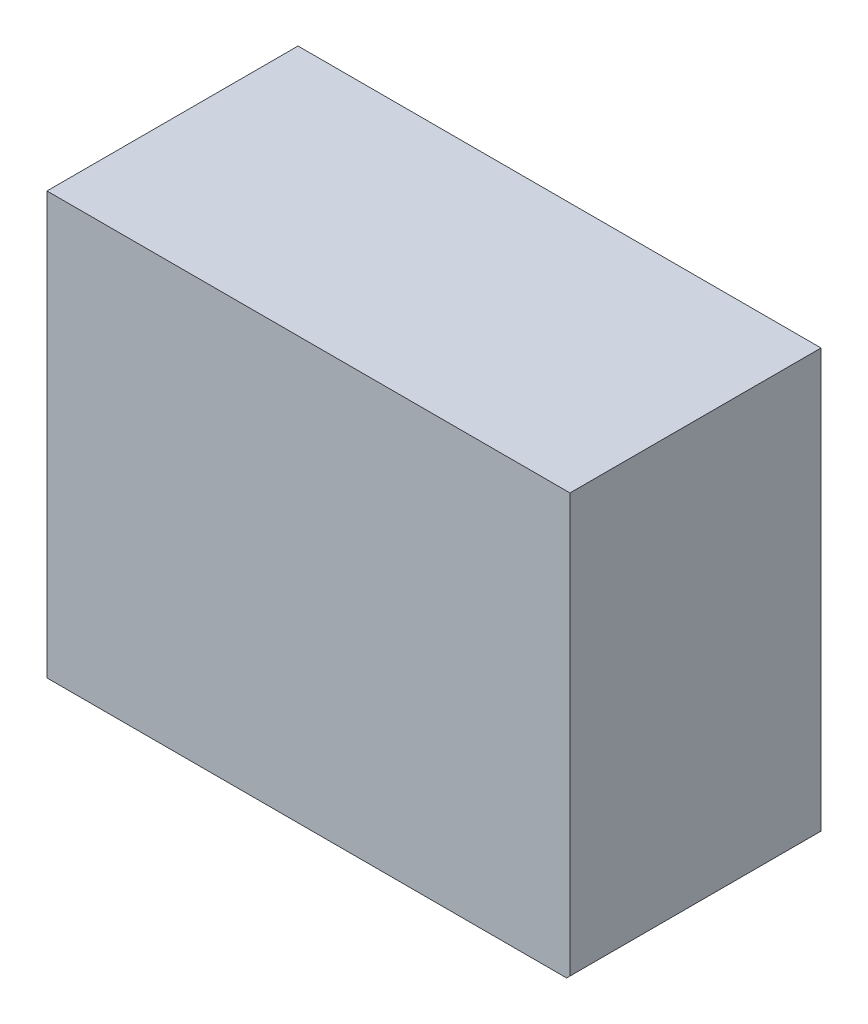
ISO-10303-21;
HEADER;
FILE_DESCRIPTION(('STEP AP214'),'2;1');
FILE_NAME('part.step','',(''),(''),'','','');
FILE_SCHEMA(('AUTOMOTIVE_DESIGN { 1 0 10303 214 1 1 1 1 }'));
ENDSEC;
DATA;
#1=APPLICATION_CONTEXT('core data for automotive mechanical design processes');
#2=APPLICATION_PROTOCOL_DEFINITION('international standard','automotive_design',2000,#1);
#3=PRODUCT_CONTEXT('',#1,'mechanical');
#4=PRODUCT('Part','Part','',(#3));
#5=PRODUCT_RELATED_PRODUCT_CATEGORY('part','',(#4));
#6=PRODUCT_DEFINITION_FORMATION('','',#4);
#7=PRODUCT_DEFINITION_CONTEXT('part definition',#1,'design');
#8=PRODUCT_DEFINITION('design','',#6,#7);
#9=PRODUCT_DEFINITION_SHAPE('','',#8);
#10=(LENGTH_UNIT() NAMED_UNIT(*) SI_UNIT(.MILLI.,.METRE.));
#11=(NAMED_UNIT(*) PLANE_ANGLE_UNIT() SI_UNIT($,.RADIAN.));
#12=(NAMED_UNIT(*) SI_UNIT($,.STERADIAN.) SOLID_ANGLE_UNIT());
#13=UNCERTAINTY_MEASURE_WITH_UNIT(LENGTH_MEASURE(1.E-05),#10,'distance_accuracy_value','');
#14=(GEOMETRIC_REPRESENTATION_CONTEXT(3) GLOBAL_UNCERTAINTY_ASSIGNED_CONTEXT((#13)) GLOBAL_UNIT_ASSIGNED_CONTEXT((#10,
#11,#12)) REPRESENTATION_CONTEXT('',''));
#15=CARTESIAN_POINT('',(0.,0.,0.));
#16=DIRECTION('',(0.,0.,1.));
#17=DIRECTION('',(1.,0.,0.));
#18=AXIS2_PLACEMENT_3D('',#15,#16,#17);
#19=CARTESIAN_POINT('',(1.2340005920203,-1.01599998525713,0.));
#20=DIRECTION('',(1.19248806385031E-08,-1.,0.));
#21=DIRECTION('',(-1.,-1.19248806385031E-08,0.));
#22=AXIS2_PLACEMENT_3D('',#19,#20,#21);
#23=PLANE('',#22);
#24=DIRECTION('',(0.,0.,1.));
#25=VECTOR('',#24,1.);
#26=CARTESIAN_POINT('',(1.2340005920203,-1.01599998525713,0.));
#27=LINE('',#26,#25);
#28=CARTESIAN_POINT('',(1.2340005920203,-1.01599998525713,0.));
#29=VERTEX_POINT('',#28);
#30=CARTESIAN_POINT('',(1.2340005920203,-1.01599998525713,1.20000014));
#31=VERTEX_POINT('',#30);
#32=EDGE_CURVE('E11',#29,#31,#27,.T.);
#33=ORIENTED_EDGE('',*,*,#32,.T.);
#34=DIRECTION('',(-1.,-1.19248806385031E-08,0.));
#35=VECTOR('',#34,1.);
#36=CARTESIAN_POINT('',(1.2340005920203,-1.01599998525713,1.20000014));
#37=LINE('',#36,#35);
#38=CARTESIAN_POINT('',(-1.2500000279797,-1.01600001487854,1.20000014));
#39=VERTEX_POINT('',#38);
#40=EDGE_CURVE('E24',#31,#39,#37,.T.);
#41=ORIENTED_EDGE('',*,*,#40,.T.);
#42=DIRECTION('',(0.,0.,1.));
#43=VECTOR('',#42,1.);
#44=CARTESIAN_POINT('',(-1.2500000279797,-1.01600001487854,0.));
#45=LINE('',#44,#43);
#46=CARTESIAN_POINT('',(-1.2500000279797,-1.01600001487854,0.));
#47=VERTEX_POINT('',#46);
#48=EDGE_CURVE('E99',#47,#39,#45,.T.);
#49=ORIENTED_EDGE('',*,*,#48,.F.);
#50=DIRECTION('',(-1.,-1.19248806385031E-08,0.));
#51=VECTOR('',#50,1.);
#52=CARTESIAN_POINT('',(1.2340005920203,-1.01599998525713,0.));
#53=LINE('',#52,#51);
#54=EDGE_CURVE('E97',#29,#47,#53,.T.);
#55=ORIENTED_EDGE('',*,*,#54,.F.);
#56=EDGE_LOOP('',(#33,#41,#49,#55));
#57=FACE_BOUND('',#56,.T.);
#58=ADVANCED_FACE('F17',(#57),#23,.T.);
#59=CARTESIAN_POINT('',(-1.2500000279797,-1.01600001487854,0.));
#60=DIRECTION('',(-1.,-1.19248806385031E-08,0.));
#61=DIRECTION('',(-1.19248806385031E-08,1.,0.));
#62=AXIS2_PLACEMENT_3D('',#59,#60,#61);
#63=PLANE('',#62);
#64=ORIENTED_EDGE('',*,*,#48,.T.);
#65=DIRECTION('',(-1.19248806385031E-08,1.,0.));
#66=VECTOR('',#65,1.);
#67=CARTESIAN_POINT('',(-1.2500000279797,-1.01600001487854,1.20000014));
#68=LINE('',#67,#66);
#69=CARTESIAN_POINT('',(-1.25000005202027,1.00000052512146,1.20000014));
#70=VERTEX_POINT('',#69);
#71=EDGE_CURVE('E94',#39,#70,#68,.T.);
#72=ORIENTED_EDGE('',*,*,#71,.T.);
#73=DIRECTION('',(0.,0.,1.));
#74=VECTOR('',#73,1.);
#75=CARTESIAN_POINT('',(-1.25000005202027,1.00000052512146,0.));
#76=LINE('',#75,#74);
#77=CARTESIAN_POINT('',(-1.25000005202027,1.00000052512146,0.));
#78=VERTEX_POINT('',#77);
#79=EDGE_CURVE('E91',#78,#70,#76,.T.);
#80=ORIENTED_EDGE('',*,*,#79,.F.);
#81=DIRECTION('',(-1.19248806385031E-08,1.,0.));
#82=VECTOR('',#81,1.);
#83=CARTESIAN_POINT('',(-1.2500000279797,-1.01600001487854,0.));
#84=LINE('',#83,#82);
#85=EDGE_CURVE('E89',#47,#78,#84,.T.);
#86=ORIENTED_EDGE('',*,*,#85,.F.);
#87=EDGE_LOOP('',(#64,#72,#80,#86));
#88=FACE_BOUND('',#87,.T.);
#89=ADVANCED_FACE('F105',(#88),#63,.T.);
#90=CARTESIAN_POINT('',(-1.25000005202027,1.00000052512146,0.));
#91=DIRECTION('',(-1.19248806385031E-08,1.,0.));
#92=DIRECTION('',(1.,1.19248806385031E-08,0.));
#93=AXIS2_PLACEMENT_3D('',#90,#91,#92);
#94=PLANE('',#93);
#95=ORIENTED_EDGE('',*,*,#79,.T.);
#96=DIRECTION('',(1.,1.19248806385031E-08,0.));
#97=VECTOR('',#96,1.);
#98=CARTESIAN_POINT('',(-1.25000005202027,1.00000052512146,1.20000014));
#99=LINE('',#98,#97);
#100=CARTESIAN_POINT('',(1.25000002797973,1.00000055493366,1.20000014));
#101=VERTEX_POINT('',#100);
#102=EDGE_CURVE('E87',#70,#101,#99,.T.);
#103=ORIENTED_EDGE('',*,*,#102,.T.);
#104=DIRECTION('',(0.,0.,1.));
#105=VECTOR('',#104,1.);
#106=CARTESIAN_POINT('',(1.25000002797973,1.00000055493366,0.));
#107=LINE('',#106,#105);
#108=CARTESIAN_POINT('',(1.25000002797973,1.00000055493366,0.));
#109=VERTEX_POINT('',#108);
#110=EDGE_CURVE('E85',#109,#101,#107,.T.);
#111=ORIENTED_EDGE('',*,*,#110,.F.);
#112=DIRECTION('',(1.,1.19248806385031E-08,0.));
#113=VECTOR('',#112,1.);
#114=CARTESIAN_POINT('',(-1.25000005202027,1.00000052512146,0.));
#115=LINE('',#114,#113);
#116=EDGE_CURVE('E79',#78,#109,#115,.T.);
#117=ORIENTED_EDGE('',*,*,#116,.F.);
#118=EDGE_LOOP('',(#95,#103,#111,#117));
#119=FACE_BOUND('',#118,.T.);
#120=ADVANCED_FACE('F109',(#119),#94,.T.);
#121=CARTESIAN_POINT('',(1.25000002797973,1.00000055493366,0.));
#122=DIRECTION('',(1.,1.19248806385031E-08,0.));
#123=DIRECTION('',(1.19248806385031E-08,-1.,0.));
#124=AXIS2_PLACEMENT_3D('',#121,#122,#123);
#125=PLANE('',#124);
#126=ORIENTED_EDGE('',*,*,#110,.T.);
#127=DIRECTION('',(1.19248806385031E-08,-1.,0.));
#128=VECTOR('',#127,1.);
#129=CARTESIAN_POINT('',(1.25000002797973,1.00000055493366,1.20000014));
#130=LINE('',#129,#128);
#131=CARTESIAN_POINT('',(1.25000005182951,-1.00000052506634,1.20000014));
#132=VERTEX_POINT('',#131);
#133=EDGE_CURVE('E66',#101,#132,#130,.T.);
#134=ORIENTED_EDGE('',*,*,#133,.T.);
#135=DIRECTION('',(0.,0.,1.));
#136=VECTOR('',#135,1.);
#137=CARTESIAN_POINT('',(1.25000005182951,-1.00000052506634,0.));
#138=LINE('',#137,#136);
#139=CARTESIAN_POINT('',(1.25000005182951,-1.00000052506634,0.));
#140=VERTEX_POINT('',#139);
#141=EDGE_CURVE('E60',#140,#132,#138,.T.);
#142=ORIENTED_EDGE('',*,*,#141,.F.);
#143=DIRECTION('',(1.19248806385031E-08,-1.,0.));
#144=VECTOR('',#143,1.);
#145=CARTESIAN_POINT('',(1.25000002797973,1.00000055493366,0.));
#146=LINE('',#145,#144);
#147=EDGE_CURVE('E64',#109,#140,#146,.T.);
#148=ORIENTED_EDGE('',*,*,#147,.F.);
#149=EDGE_LOOP('',(#126,#134,#142,#148));
#150=FACE_BOUND('',#149,.T.);
#151=ADVANCED_FACE('F62',(#150),#125,.T.);
#152=CARTESIAN_POINT('',(1.25000005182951,-1.00000052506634,0.));
#153=DIRECTION('',(0.707106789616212,-0.707106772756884,0.));
#154=DIRECTION('',(-0.707106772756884,-0.707106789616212,0.));
#155=AXIS2_PLACEMENT_3D('',#152,#153,#154);
#156=PLANE('',#155);
#157=ORIENTED_EDGE('',*,*,#141,.T.);
#158=DIRECTION('',(-0.707106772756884,-0.707106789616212,0.));
#159=VECTOR('',#158,1.);
#160=CARTESIAN_POINT('',(1.25000005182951,-1.00000052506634,1.20000014));
#161=LINE('',#160,#159);
#162=EDGE_CURVE('E74',#132,#31,#161,.T.);
#163=ORIENTED_EDGE('',*,*,#162,.T.);
#164=ORIENTED_EDGE('',*,*,#32,.F.);
#165=DIRECTION('',(-0.707106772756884,-0.707106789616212,0.));
#166=VECTOR('',#165,1.);
#167=CARTESIAN_POINT('',(1.25000005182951,-1.00000052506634,0.));
#168=LINE('',#167,#166);
#169=EDGE_CURVE('E70',#140,#29,#168,.T.);
#170=ORIENTED_EDGE('',*,*,#169,.F.);
#171=EDGE_LOOP('',(#157,#163,#164,#170));
#172=FACE_BOUND('',#171,.T.);
#173=ADVANCED_FACE('F71',(#172),#156,.T.);
#174=CARTESIAN_POINT('',(1.2340005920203,-1.01599998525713,0.));
#175=DIRECTION('',(0.,0.,1.));
#176=DIRECTION('',(1.19248806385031E-08,-1.,0.));
#177=AXIS2_PLACEMENT_3D('',#174,#175,#176);
#178=PLANE('',#177);
#179=ORIENTED_EDGE('',*,*,#54,.T.);
#180=ORIENTED_EDGE('',*,*,#85,.T.);
#181=ORIENTED_EDGE('',*,*,#116,.T.);
#182=ORIENTED_EDGE('',*,*,#147,.T.);
#183=ORIENTED_EDGE('',*,*,#169,.T.);
#184=EDGE_LOOP('',(#179,#180,#181,#182,#183));
#185=FACE_BOUND('',#184,.T.);
#186=ADVANCED_FACE('F77',(#185),#178,.F.);
#187=CARTESIAN_POINT('',(1.2340005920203,-1.01599998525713,1.20000014));
#188=DIRECTION('',(0.,0.,1.));
#189=DIRECTION('',(1.19248806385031E-08,-1.,0.));
#190=AXIS2_PLACEMENT_3D('',#187,#188,#189);
#191=PLANE('',#190);
#192=ORIENTED_EDGE('',*,*,#162,.F.);
#193=ORIENTED_EDGE('',*,*,#133,.F.);
#194=ORIENTED_EDGE('',*,*,#102,.F.);
#195=ORIENTED_EDGE('',*,*,#71,.F.);
#196=ORIENTED_EDGE('',*,*,#40,.F.);
#197=EDGE_LOOP('',(#192,#193,#194,#195,#196));
#198=FACE_BOUND('',#197,.T.);
#199=ADVANCED_FACE('F107',(#198),#191,.T.);
#200=CLOSED_SHELL('',(#58,#89,#120,#151,#173,#186,#199));
#201=MANIFOLD_SOLID_BREP('B1',#200);
#202=ADVANCED_BREP_SHAPE_REPRESENTATION('',(#18,#201),#14);
#203=SHAPE_DEFINITION_REPRESENTATION(#9,#202);
ENDSEC;
END-ISO-10303-21;
